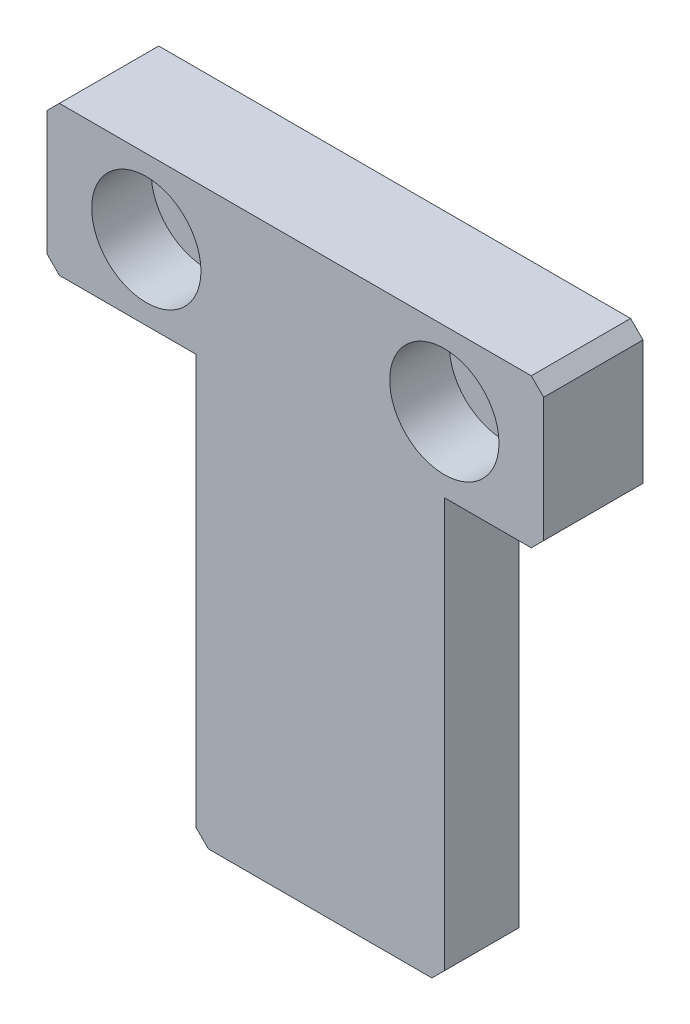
from build123d import *

# Parameters (mm, degrees)
BOSS_EXTRU_1_DEPTH                                 = 4
CHAMBRAGE_POUR_VIS_T_TE_HEXAGONALE_M21_D           = 2.4
CHAMBRAGE_POUR_VIS_T_TE_HEXAGONALE_M21_CBORE_D     = 4.4
CHAMBRAGE_POUR_VIS_T_TE_HEXAGONALE_M21_CBORE_DEPTH = 2.4
CHANFREIN1_SIZE                                    = 0.5
ESQUISSE4_W                                        = 20
ESQUISSE4_H                                        = 17
ENL_V_MAT_EXTRU_1_DEPTH                            = 1


with BuildPart() as part:
    # Esquisse1 → Boss.-Extru.1 (new body)
    with BuildSketch(Plane.XY):
        Polygon((0, 23), (20, 23), (20, 17), (16, 17), (16, 0), (6, 0), (6, 17), (0, 17), align=None)
    extrude(amount=BOSS_EXTRU_1_DEPTH)

    # Chambrage pour vis _ t_te hexagonale M21 (through all)
    with Locations(Plane.XY.offset(4)):
        with Locations((4, 20), (16, 20)):
            CounterBoreHole(CHAMBRAGE_POUR_VIS_T_TE_HEXAGONALE_M21_D / 2, CHAMBRAGE_POUR_VIS_T_TE_HEXAGONALE_M21_CBORE_D / 2, CHAMBRAGE_POUR_VIS_T_TE_HEXAGONALE_M21_CBORE_DEPTH)

    # Chanfrein1
    chanfrein1_edges = [part.edges().sort_by_distance(p)[0] for p in [
        (0, 23, 2),
        (20, 23, 2),
        (20, 17, 2),
        (16, 0, 2),
        (6, 0, 2),
        (0, 17, 2),
    ]]
    chamfer(chanfrein1_edges, length=CHANFREIN1_SIZE)

    # Esquisse4 → Enl_v. mat.-Extru.1 (cut)
    with BuildSketch(Plane(origin=(0, 0, 0), x_dir=(-1, 0, 0), z_dir=(0, 0, -1))):
        with Locations((-10, 8.5)):
            Rectangle(ESQUISSE4_W, ESQUISSE4_H)
    extrude(amount=-ENL_V_MAT_EXTRU_1_DEPTH, mode=Mode.SUBTRACT)


solid = part.part
